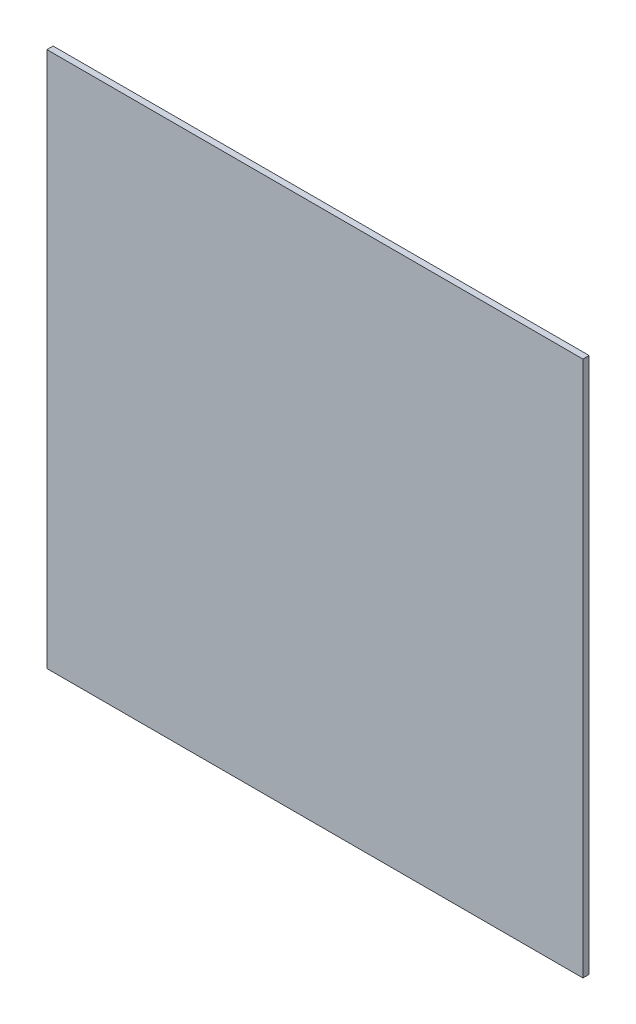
from build123d import *

# Parameters (mm, degrees)
ESQUISSE1_W        = 259.6
ESQUISSE1_H        = 259.6
BOSS_EXTRU_1_DEPTH = 3


with BuildPart() as part:
    # Esquisse1 → Boss.-Extru.1 (new body)
    with BuildSketch(Plane.XY):
        Rectangle(ESQUISSE1_W, ESQUISSE1_H)
    extrude(amount=BOSS_EXTRU_1_DEPTH)


solid = part.part
